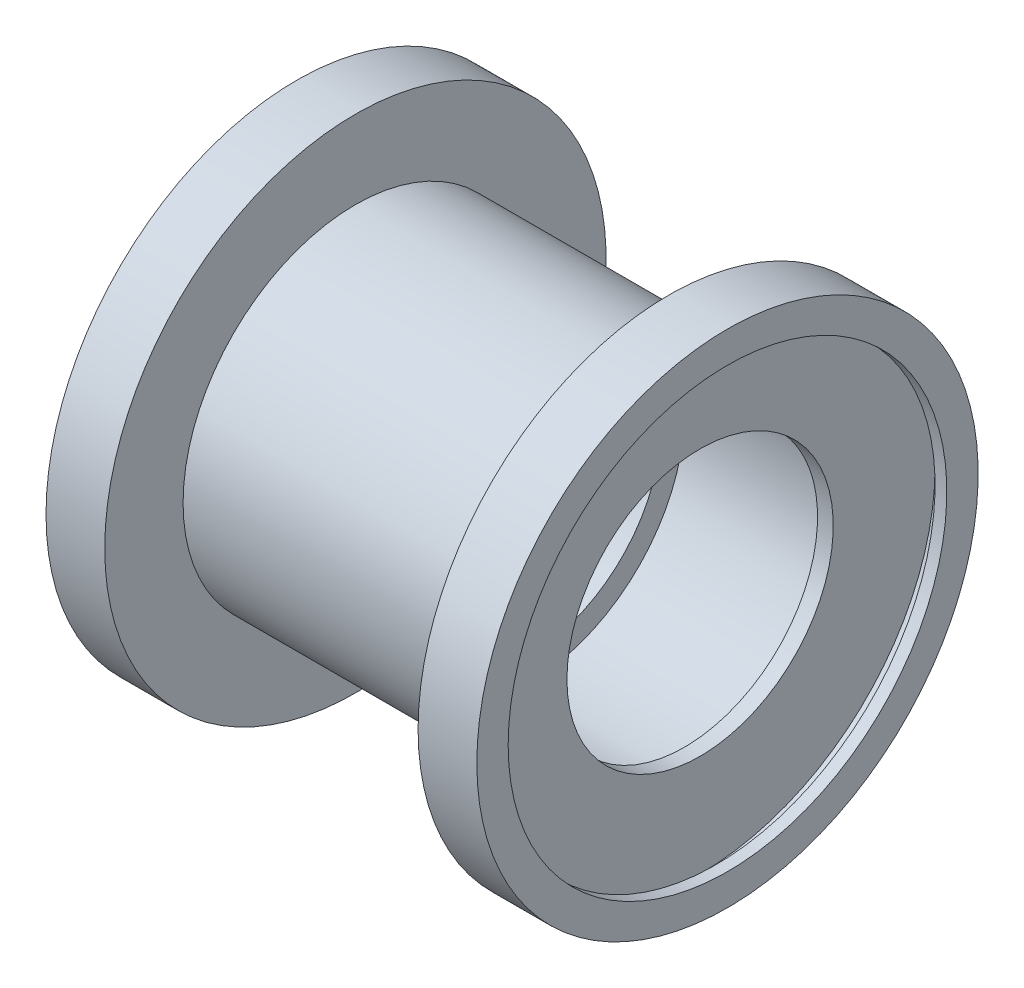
ISO-10303-21;
HEADER;
FILE_DESCRIPTION(('STEP AP214'),'2;1');
FILE_NAME('part.step','',(''),(''),'','','');
FILE_SCHEMA(('AUTOMOTIVE_DESIGN { 1 0 10303 214 1 1 1 1 }'));
ENDSEC;
DATA;
#1=APPLICATION_CONTEXT('core data for automotive mechanical design processes');
#2=APPLICATION_PROTOCOL_DEFINITION('international standard','automotive_design',2000,#1);
#3=PRODUCT_CONTEXT('',#1,'mechanical');
#4=PRODUCT('Part','Part','',(#3));
#5=PRODUCT_RELATED_PRODUCT_CATEGORY('part','',(#4));
#6=PRODUCT_DEFINITION_FORMATION('','',#4);
#7=PRODUCT_DEFINITION_CONTEXT('part definition',#1,'design');
#8=PRODUCT_DEFINITION('design','',#6,#7);
#9=PRODUCT_DEFINITION_SHAPE('','',#8);
#10=(LENGTH_UNIT() NAMED_UNIT(*) SI_UNIT(.MILLI.,.METRE.));
#11=(NAMED_UNIT(*) PLANE_ANGLE_UNIT() SI_UNIT($,.RADIAN.));
#12=(NAMED_UNIT(*) SI_UNIT($,.STERADIAN.) SOLID_ANGLE_UNIT());
#13=UNCERTAINTY_MEASURE_WITH_UNIT(LENGTH_MEASURE(1.E-05),#10,'distance_accuracy_value','');
#14=(GEOMETRIC_REPRESENTATION_CONTEXT(3) GLOBAL_UNCERTAINTY_ASSIGNED_CONTEXT((#13)) GLOBAL_UNIT_ASSIGNED_CONTEXT((#10,
#11,#12)) REPRESENTATION_CONTEXT('',''));
#15=CARTESIAN_POINT('',(0.,0.,0.));
#16=DIRECTION('',(0.,0.,1.));
#17=DIRECTION('',(1.,0.,0.));
#18=AXIS2_PLACEMENT_3D('',#15,#16,#17);
#19=CARTESIAN_POINT('',(0.,0.,0.));
#20=DIRECTION('',(-1.,0.,0.));
#21=DIRECTION('',(0.,0.,1.));
#22=AXIS2_PLACEMENT_3D('',#19,#20,#21);
#23=CYLINDRICAL_SURFACE('',#22,8.5);
#24=CARTESIAN_POINT('',(1.,0.,0.));
#25=DIRECTION('',(-1.,0.,0.));
#26=DIRECTION('',(0.,0.,1.));
#27=AXIS2_PLACEMENT_3D('',#24,#25,#26);
#28=CIRCLE('',#27,8.5);
#29=CARTESIAN_POINT('',(1.,0.,8.5));
#30=VERTEX_POINT('',#29);
#31=EDGE_CURVE('E68',#30,#30,#28,.T.);
#32=ORIENTED_EDGE('',*,*,#31,.F.);
#33=EDGE_LOOP('',(#32));
#34=FACE_BOUND('',#33,.T.);
#35=CARTESIAN_POINT('',(-1.,0.,0.));
#36=DIRECTION('',(-1.,0.,0.));
#37=DIRECTION('',(0.,0.,1.));
#38=AXIS2_PLACEMENT_3D('',#35,#36,#37);
#39=CIRCLE('',#38,8.5);
#40=CARTESIAN_POINT('',(-1.,0.,8.5));
#41=VERTEX_POINT('',#40);
#42=EDGE_CURVE('E104',#41,#41,#39,.T.);
#43=ORIENTED_EDGE('',*,*,#42,.T.);
#44=EDGE_LOOP('',(#43));
#45=FACE_BOUND('',#44,.T.);
#46=ADVANCED_FACE('F28',(#34,#45),#23,.F.);
#47=CARTESIAN_POINT('',(0.,0.,0.));
#48=DIRECTION('',(-1.,0.,0.));
#49=DIRECTION('',(0.,0.,1.));
#50=AXIS2_PLACEMENT_3D('',#47,#48,#49);
#51=CYLINDRICAL_SURFACE('',#50,11.);
#52=CARTESIAN_POINT('',(10.,0.,0.));
#53=DIRECTION('',(-1.,0.,0.));
#54=DIRECTION('',(0.,0.,1.));
#55=AXIS2_PLACEMENT_3D('',#52,#53,#54);
#56=CIRCLE('',#55,11.);
#57=CARTESIAN_POINT('',(10.,0.,11.));
#58=VERTEX_POINT('',#57);
#59=EDGE_CURVE('E10',#58,#58,#56,.T.);
#60=ORIENTED_EDGE('',*,*,#59,.T.);
#61=EDGE_LOOP('',(#60));
#62=FACE_BOUND('',#61,.T.);
#63=CARTESIAN_POINT('',(-10.,0.,0.));
#64=DIRECTION('',(-1.,0.,0.));
#65=DIRECTION('',(0.,0.,1.));
#66=AXIS2_PLACEMENT_3D('',#63,#64,#65);
#67=CIRCLE('',#66,11.);
#68=CARTESIAN_POINT('',(-10.,0.,11.));
#69=VERTEX_POINT('',#68);
#70=EDGE_CURVE('E71',#69,#69,#67,.T.);
#71=ORIENTED_EDGE('',*,*,#70,.F.);
#72=EDGE_LOOP('',(#71));
#73=FACE_BOUND('',#72,.T.);
#74=ADVANCED_FACE('F121',(#62,#73),#51,.T.);
#75=CARTESIAN_POINT('',(10.,11.,0.));
#76=DIRECTION('',(1.,0.,0.));
#77=DIRECTION('',(0.,0.,-1.));
#78=AXIS2_PLACEMENT_3D('',#75,#76,#77);
#79=PLANE('',#78);
#80=ORIENTED_EDGE('',*,*,#59,.F.);
#81=EDGE_LOOP('',(#80));
#82=FACE_BOUND('',#81,.T.);
#83=CARTESIAN_POINT('',(10.,0.,0.));
#84=DIRECTION('',(-1.,0.,0.));
#85=DIRECTION('',(0.,0.,1.));
#86=AXIS2_PLACEMENT_3D('',#83,#84,#85);
#87=CIRCLE('',#86,16.);
#88=CARTESIAN_POINT('',(10.,0.,16.));
#89=VERTEX_POINT('',#88);
#90=EDGE_CURVE('E34',#89,#89,#87,.T.);
#91=ORIENTED_EDGE('',*,*,#90,.T.);
#92=EDGE_LOOP('',(#91));
#93=FACE_BOUND('',#92,.T.);
#94=ADVANCED_FACE('F126',(#82,#93),#79,.F.);
#95=CARTESIAN_POINT('',(0.,0.,0.));
#96=DIRECTION('',(-1.,0.,0.));
#97=DIRECTION('',(0.,0.,1.));
#98=AXIS2_PLACEMENT_3D('',#95,#96,#97);
#99=CYLINDRICAL_SURFACE('',#98,16.);
#100=ORIENTED_EDGE('',*,*,#90,.F.);
#101=EDGE_LOOP('',(#100));
#102=FACE_BOUND('',#101,.T.);
#103=CARTESIAN_POINT('',(13.75,0.,0.));
#104=DIRECTION('',(-1.,0.,0.));
#105=DIRECTION('',(0.,0.,1.));
#106=AXIS2_PLACEMENT_3D('',#103,#104,#105);
#107=CIRCLE('',#106,16.);
#108=CARTESIAN_POINT('',(13.75,0.,16.));
#109=VERTEX_POINT('',#108);
#110=EDGE_CURVE('E38',#109,#109,#107,.T.);
#111=ORIENTED_EDGE('',*,*,#110,.T.);
#112=EDGE_LOOP('',(#111));
#113=FACE_BOUND('',#112,.T.);
#114=ADVANCED_FACE('F174',(#102,#113),#99,.T.);
#115=CARTESIAN_POINT('',(13.75,16.,0.));
#116=DIRECTION('',(-1.,0.,0.));
#117=DIRECTION('',(0.,0.,1.));
#118=AXIS2_PLACEMENT_3D('',#115,#116,#117);
#119=PLANE('',#118);
#120=ORIENTED_EDGE('',*,*,#110,.F.);
#121=EDGE_LOOP('',(#120));
#122=FACE_BOUND('',#121,.T.);
#123=CARTESIAN_POINT('',(13.75,0.,0.));
#124=DIRECTION('',(-1.,0.,0.));
#125=DIRECTION('',(0.,0.,1.));
#126=AXIS2_PLACEMENT_3D('',#123,#124,#125);
#127=CIRCLE('',#126,14.);
#128=CARTESIAN_POINT('',(13.75,0.,14.));
#129=VERTEX_POINT('',#128);
#130=EDGE_CURVE('E42',#129,#129,#127,.T.);
#131=ORIENTED_EDGE('',*,*,#130,.T.);
#132=EDGE_LOOP('',(#131));
#133=FACE_BOUND('',#132,.T.);
#134=ADVANCED_FACE('F170',(#122,#133),#119,.F.);
#135=CARTESIAN_POINT('',(0.,0.,0.));
#136=DIRECTION('',(-1.,0.,0.));
#137=DIRECTION('',(0.,0.,1.));
#138=AXIS2_PLACEMENT_3D('',#135,#136,#137);
#139=CYLINDRICAL_SURFACE('',#138,14.);
#140=ORIENTED_EDGE('',*,*,#130,.F.);
#141=EDGE_LOOP('',(#140));
#142=FACE_BOUND('',#141,.T.);
#143=CARTESIAN_POINT('',(13.,0.,0.));
#144=DIRECTION('',(-1.,0.,0.));
#145=DIRECTION('',(0.,0.,1.));
#146=AXIS2_PLACEMENT_3D('',#143,#144,#145);
#147=CIRCLE('',#146,14.);
#148=CARTESIAN_POINT('',(13.,0.,14.));
#149=VERTEX_POINT('',#148);
#150=EDGE_CURVE('E47',#149,#149,#147,.T.);
#151=ORIENTED_EDGE('',*,*,#150,.T.);
#152=EDGE_LOOP('',(#151));
#153=FACE_BOUND('',#152,.T.);
#154=ADVANCED_FACE('F166',(#142,#153),#139,.F.);
#155=CARTESIAN_POINT('',(13.,14.,0.));
#156=DIRECTION('',(1.,0.,0.));
#157=DIRECTION('',(0.,0.,-1.));
#158=AXIS2_PLACEMENT_3D('',#155,#156,#157);
#159=PLANE('',#158);
#160=ORIENTED_EDGE('',*,*,#150,.F.);
#161=EDGE_LOOP('',(#160));
#162=FACE_BOUND('',#161,.T.);
#163=CARTESIAN_POINT('',(13.,0.,0.));
#164=DIRECTION('',(-1.,0.,0.));
#165=DIRECTION('',(0.,0.,1.));
#166=AXIS2_PLACEMENT_3D('',#163,#164,#165);
#167=CIRCLE('',#166,15.);
#168=CARTESIAN_POINT('',(13.,0.,15.));
#169=VERTEX_POINT('',#168);
#170=EDGE_CURVE('E50',#169,#169,#167,.T.);
#171=ORIENTED_EDGE('',*,*,#170,.T.);
#172=EDGE_LOOP('',(#171));
#173=FACE_BOUND('',#172,.T.);
#174=ADVANCED_FACE('F162',(#162,#173),#159,.F.);
#175=CARTESIAN_POINT('',(0.,0.,0.));
#176=DIRECTION('',(-1.,0.,0.));
#177=DIRECTION('',(0.,0.,1.));
#178=AXIS2_PLACEMENT_3D('',#175,#176,#177);
#179=CYLINDRICAL_SURFACE('',#178,15.);
#180=ORIENTED_EDGE('',*,*,#170,.F.);
#181=EDGE_LOOP('',(#180));
#182=FACE_BOUND('',#181,.T.);
#183=CARTESIAN_POINT('',(12.,0.,0.));
#184=DIRECTION('',(-1.,0.,0.));
#185=DIRECTION('',(0.,0.,1.));
#186=AXIS2_PLACEMENT_3D('',#183,#184,#185);
#187=CIRCLE('',#186,15.);
#188=CARTESIAN_POINT('',(12.,0.,15.));
#189=VERTEX_POINT('',#188);
#190=EDGE_CURVE('E53',#189,#189,#187,.T.);
#191=ORIENTED_EDGE('',*,*,#190,.T.);
#192=EDGE_LOOP('',(#191));
#193=FACE_BOUND('',#192,.T.);
#194=ADVANCED_FACE('F158',(#182,#193),#179,.F.);
#195=CARTESIAN_POINT('',(12.,15.,0.));
#196=DIRECTION('',(-1.,0.,0.));
#197=DIRECTION('',(0.,0.,1.));
#198=AXIS2_PLACEMENT_3D('',#195,#196,#197);
#199=PLANE('',#198);
#200=ORIENTED_EDGE('',*,*,#190,.F.);
#201=EDGE_LOOP('',(#200));
#202=FACE_BOUND('',#201,.T.);
#203=CARTESIAN_POINT('',(12.,0.,0.));
#204=DIRECTION('',(-1.,0.,0.));
#205=DIRECTION('',(0.,0.,1.));
#206=AXIS2_PLACEMENT_3D('',#203,#204,#205);
#207=CIRCLE('',#206,8.5);
#208=CARTESIAN_POINT('',(12.,0.,8.5));
#209=VERTEX_POINT('',#208);
#210=EDGE_CURVE('E56',#209,#209,#207,.T.);
#211=ORIENTED_EDGE('',*,*,#210,.T.);
#212=EDGE_LOOP('',(#211));
#213=FACE_BOUND('',#212,.T.);
#214=ADVANCED_FACE('F154',(#202,#213),#199,.F.);
#215=CARTESIAN_POINT('',(0.,0.,0.));
#216=DIRECTION('',(-1.,0.,0.));
#217=DIRECTION('',(0.,0.,1.));
#218=AXIS2_PLACEMENT_3D('',#215,#216,#217);
#219=CYLINDRICAL_SURFACE('',#218,8.5);
#220=ORIENTED_EDGE('',*,*,#210,.F.);
#221=EDGE_LOOP('',(#220));
#222=FACE_BOUND('',#221,.T.);
#223=CARTESIAN_POINT('',(11.,0.,0.));
#224=DIRECTION('',(-1.,0.,0.));
#225=DIRECTION('',(0.,0.,1.));
#226=AXIS2_PLACEMENT_3D('',#223,#224,#225);
#227=CIRCLE('',#226,8.5);
#228=CARTESIAN_POINT('',(11.,0.,8.5));
#229=VERTEX_POINT('',#228);
#230=EDGE_CURVE('E59',#229,#229,#227,.T.);
#231=ORIENTED_EDGE('',*,*,#230,.T.);
#232=EDGE_LOOP('',(#231));
#233=FACE_BOUND('',#232,.T.);
#234=ADVANCED_FACE('F150',(#222,#233),#219,.F.);
#235=CARTESIAN_POINT('',(11.,8.5,0.));
#236=DIRECTION('',(1.,0.,0.));
#237=DIRECTION('',(0.,0.,-1.));
#238=AXIS2_PLACEMENT_3D('',#235,#236,#237);
#239=PLANE('',#238);
#240=ORIENTED_EDGE('',*,*,#230,.F.);
#241=EDGE_LOOP('',(#240));
#242=FACE_BOUND('',#241,.T.);
#243=CARTESIAN_POINT('',(11.,0.,0.));
#244=DIRECTION('',(-1.,0.,0.));
#245=DIRECTION('',(0.,0.,1.));
#246=AXIS2_PLACEMENT_3D('',#243,#244,#245);
#247=CIRCLE('',#246,10.);
#248=CARTESIAN_POINT('',(11.,0.,10.));
#249=VERTEX_POINT('',#248);
#250=EDGE_CURVE('E62',#249,#249,#247,.T.);
#251=ORIENTED_EDGE('',*,*,#250,.T.);
#252=EDGE_LOOP('',(#251));
#253=FACE_BOUND('',#252,.T.);
#254=ADVANCED_FACE('F142',(#242,#253),#239,.F.);
#255=CARTESIAN_POINT('',(0.,0.,0.));
#256=DIRECTION('',(-1.,0.,0.));
#257=DIRECTION('',(0.,0.,1.));
#258=AXIS2_PLACEMENT_3D('',#255,#256,#257);
#259=CYLINDRICAL_SURFACE('',#258,9.99999999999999);
#260=ORIENTED_EDGE('',*,*,#250,.F.);
#261=EDGE_LOOP('',(#260));
#262=FACE_BOUND('',#261,.T.);
#263=CARTESIAN_POINT('',(1.,0.,0.));
#264=DIRECTION('',(-1.,0.,0.));
#265=DIRECTION('',(0.,0.,1.));
#266=AXIS2_PLACEMENT_3D('',#263,#264,#265);
#267=CIRCLE('',#266,9.99999999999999);
#268=CARTESIAN_POINT('',(1.,0.,9.99999999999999));
#269=VERTEX_POINT('',#268);
#270=EDGE_CURVE('E65',#269,#269,#267,.T.);
#271=ORIENTED_EDGE('',*,*,#270,.T.);
#272=EDGE_LOOP('',(#271));
#273=FACE_BOUND('',#272,.T.);
#274=ADVANCED_FACE('F132',(#262,#273),#259,.F.);
#275=CARTESIAN_POINT('',(1.,9.99999999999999,0.));
#276=DIRECTION('',(-1.,0.,0.));
#277=DIRECTION('',(0.,0.,1.));
#278=AXIS2_PLACEMENT_3D('',#275,#276,#277);
#279=PLANE('',#278);
#280=ORIENTED_EDGE('',*,*,#270,.F.);
#281=EDGE_LOOP('',(#280));
#282=FACE_BOUND('',#281,.T.);
#283=ORIENTED_EDGE('',*,*,#31,.T.);
#284=EDGE_LOOP('',(#283));
#285=FACE_BOUND('',#284,.T.);
#286=ADVANCED_FACE('F129',(#282,#285),#279,.F.);
#287=CARTESIAN_POINT('',(-10.,11.,0.));
#288=DIRECTION('',(-1.,0.,0.));
#289=DIRECTION('',(0.,0.,-1.));
#290=AXIS2_PLACEMENT_3D('',#287,#288,#289);
#291=PLANE('',#290);
#292=ORIENTED_EDGE('',*,*,#70,.T.);
#293=EDGE_LOOP('',(#292));
#294=FACE_BOUND('',#293,.T.);
#295=CARTESIAN_POINT('',(-10.,0.,0.));
#296=DIRECTION('',(-1.,0.,0.));
#297=DIRECTION('',(0.,0.,1.));
#298=AXIS2_PLACEMENT_3D('',#295,#296,#297);
#299=CIRCLE('',#298,16.);
#300=CARTESIAN_POINT('',(-10.,0.,16.));
#301=VERTEX_POINT('',#300);
#302=EDGE_CURVE('E74',#301,#301,#299,.T.);
#303=ORIENTED_EDGE('',*,*,#302,.F.);
#304=EDGE_LOOP('',(#303));
#305=FACE_BOUND('',#304,.T.);
#306=ADVANCED_FACE('F131',(#294,#305),#291,.F.);
#307=CARTESIAN_POINT('',(0.,0.,0.));
#308=DIRECTION('',(1.,0.,0.));
#309=DIRECTION('',(0.,0.,1.));
#310=AXIS2_PLACEMENT_3D('',#307,#308,#309);
#311=CYLINDRICAL_SURFACE('',#310,16.);
#312=ORIENTED_EDGE('',*,*,#302,.T.);
#313=EDGE_LOOP('',(#312));
#314=FACE_BOUND('',#313,.T.);
#315=CARTESIAN_POINT('',(-13.75,0.,0.));
#316=DIRECTION('',(-1.,0.,0.));
#317=DIRECTION('',(0.,0.,1.));
#318=AXIS2_PLACEMENT_3D('',#315,#316,#317);
#319=CIRCLE('',#318,16.);
#320=CARTESIAN_POINT('',(-13.75,0.,16.));
#321=VERTEX_POINT('',#320);
#322=EDGE_CURVE('E77',#321,#321,#319,.T.);
#323=ORIENTED_EDGE('',*,*,#322,.F.);
#324=EDGE_LOOP('',(#323));
#325=FACE_BOUND('',#324,.T.);
#326=ADVANCED_FACE('F139',(#314,#325),#311,.T.);
#327=CARTESIAN_POINT('',(-13.75,16.,0.));
#328=DIRECTION('',(1.,0.,0.));
#329=DIRECTION('',(0.,0.,1.));
#330=AXIS2_PLACEMENT_3D('',#327,#328,#329);
#331=PLANE('',#330);
#332=ORIENTED_EDGE('',*,*,#322,.T.);
#333=EDGE_LOOP('',(#332));
#334=FACE_BOUND('',#333,.T.);
#335=CARTESIAN_POINT('',(-13.75,0.,0.));
#336=DIRECTION('',(-1.,0.,0.));
#337=DIRECTION('',(0.,0.,1.));
#338=AXIS2_PLACEMENT_3D('',#335,#336,#337);
#339=CIRCLE('',#338,14.);
#340=CARTESIAN_POINT('',(-13.75,0.,14.));
#341=VERTEX_POINT('',#340);
#342=EDGE_CURVE('E80',#341,#341,#339,.T.);
#343=ORIENTED_EDGE('',*,*,#342,.F.);
#344=EDGE_LOOP('',(#343));
#345=FACE_BOUND('',#344,.T.);
#346=ADVANCED_FACE('F242',(#334,#345),#331,.F.);
#347=CARTESIAN_POINT('',(0.,0.,0.));
#348=DIRECTION('',(1.,0.,0.));
#349=DIRECTION('',(0.,0.,1.));
#350=AXIS2_PLACEMENT_3D('',#347,#348,#349);
#351=CYLINDRICAL_SURFACE('',#350,14.);
#352=ORIENTED_EDGE('',*,*,#342,.T.);
#353=EDGE_LOOP('',(#352));
#354=FACE_BOUND('',#353,.T.);
#355=CARTESIAN_POINT('',(-13.,0.,0.));
#356=DIRECTION('',(-1.,0.,0.));
#357=DIRECTION('',(0.,0.,1.));
#358=AXIS2_PLACEMENT_3D('',#355,#356,#357);
#359=CIRCLE('',#358,14.);
#360=CARTESIAN_POINT('',(-13.,0.,14.));
#361=VERTEX_POINT('',#360);
#362=EDGE_CURVE('E83',#361,#361,#359,.T.);
#363=ORIENTED_EDGE('',*,*,#362,.F.);
#364=EDGE_LOOP('',(#363));
#365=FACE_BOUND('',#364,.T.);
#366=ADVANCED_FACE('F251',(#354,#365),#351,.F.);
#367=CARTESIAN_POINT('',(-13.,14.,0.));
#368=DIRECTION('',(-1.,0.,0.));
#369=DIRECTION('',(0.,0.,-1.));
#370=AXIS2_PLACEMENT_3D('',#367,#368,#369);
#371=PLANE('',#370);
#372=ORIENTED_EDGE('',*,*,#362,.T.);
#373=EDGE_LOOP('',(#372));
#374=FACE_BOUND('',#373,.T.);
#375=CARTESIAN_POINT('',(-13.,0.,0.));
#376=DIRECTION('',(-1.,0.,0.));
#377=DIRECTION('',(0.,0.,1.));
#378=AXIS2_PLACEMENT_3D('',#375,#376,#377);
#379=CIRCLE('',#378,15.);
#380=CARTESIAN_POINT('',(-13.,0.,15.));
#381=VERTEX_POINT('',#380);
#382=EDGE_CURVE('E86',#381,#381,#379,.T.);
#383=ORIENTED_EDGE('',*,*,#382,.F.);
#384=EDGE_LOOP('',(#383));
#385=FACE_BOUND('',#384,.T.);
#386=ADVANCED_FACE('F261',(#374,#385),#371,.F.);
#387=CARTESIAN_POINT('',(0.,0.,0.));
#388=DIRECTION('',(1.,0.,0.));
#389=DIRECTION('',(0.,0.,1.));
#390=AXIS2_PLACEMENT_3D('',#387,#388,#389);
#391=CYLINDRICAL_SURFACE('',#390,15.);
#392=ORIENTED_EDGE('',*,*,#382,.T.);
#393=EDGE_LOOP('',(#392));
#394=FACE_BOUND('',#393,.T.);
#395=CARTESIAN_POINT('',(-12.,0.,0.));
#396=DIRECTION('',(-1.,0.,0.));
#397=DIRECTION('',(0.,0.,1.));
#398=AXIS2_PLACEMENT_3D('',#395,#396,#397);
#399=CIRCLE('',#398,15.);
#400=CARTESIAN_POINT('',(-12.,0.,15.));
#401=VERTEX_POINT('',#400);
#402=EDGE_CURVE('E89',#401,#401,#399,.T.);
#403=ORIENTED_EDGE('',*,*,#402,.F.);
#404=EDGE_LOOP('',(#403));
#405=FACE_BOUND('',#404,.T.);
#406=ADVANCED_FACE('F271',(#394,#405),#391,.F.);
#407=CARTESIAN_POINT('',(-12.,15.,0.));
#408=DIRECTION('',(1.,0.,0.));
#409=DIRECTION('',(0.,0.,1.));
#410=AXIS2_PLACEMENT_3D('',#407,#408,#409);
#411=PLANE('',#410);
#412=ORIENTED_EDGE('',*,*,#402,.T.);
#413=EDGE_LOOP('',(#412));
#414=FACE_BOUND('',#413,.T.);
#415=CARTESIAN_POINT('',(-12.,0.,0.));
#416=DIRECTION('',(-1.,0.,0.));
#417=DIRECTION('',(0.,0.,1.));
#418=AXIS2_PLACEMENT_3D('',#415,#416,#417);
#419=CIRCLE('',#418,8.5);
#420=CARTESIAN_POINT('',(-12.,0.,8.5));
#421=VERTEX_POINT('',#420);
#422=EDGE_CURVE('E92',#421,#421,#419,.T.);
#423=ORIENTED_EDGE('',*,*,#422,.F.);
#424=EDGE_LOOP('',(#423));
#425=FACE_BOUND('',#424,.T.);
#426=ADVANCED_FACE('F281',(#414,#425),#411,.F.);
#427=CARTESIAN_POINT('',(0.,0.,0.));
#428=DIRECTION('',(1.,0.,0.));
#429=DIRECTION('',(0.,0.,1.));
#430=AXIS2_PLACEMENT_3D('',#427,#428,#429);
#431=CYLINDRICAL_SURFACE('',#430,8.5);
#432=ORIENTED_EDGE('',*,*,#422,.T.);
#433=EDGE_LOOP('',(#432));
#434=FACE_BOUND('',#433,.T.);
#435=CARTESIAN_POINT('',(-11.,0.,0.));
#436=DIRECTION('',(-1.,0.,0.));
#437=DIRECTION('',(0.,0.,1.));
#438=AXIS2_PLACEMENT_3D('',#435,#436,#437);
#439=CIRCLE('',#438,8.5);
#440=CARTESIAN_POINT('',(-11.,0.,8.5));
#441=VERTEX_POINT('',#440);
#442=EDGE_CURVE('E95',#441,#441,#439,.T.);
#443=ORIENTED_EDGE('',*,*,#442,.F.);
#444=EDGE_LOOP('',(#443));
#445=FACE_BOUND('',#444,.T.);
#446=ADVANCED_FACE('F291',(#434,#445),#431,.F.);
#447=CARTESIAN_POINT('',(-11.,8.5,0.));
#448=DIRECTION('',(-1.,0.,0.));
#449=DIRECTION('',(0.,0.,-1.));
#450=AXIS2_PLACEMENT_3D('',#447,#448,#449);
#451=PLANE('',#450);
#452=ORIENTED_EDGE('',*,*,#442,.T.);
#453=EDGE_LOOP('',(#452));
#454=FACE_BOUND('',#453,.T.);
#455=CARTESIAN_POINT('',(-11.,0.,0.));
#456=DIRECTION('',(-1.,0.,0.));
#457=DIRECTION('',(0.,0.,1.));
#458=AXIS2_PLACEMENT_3D('',#455,#456,#457);
#459=CIRCLE('',#458,10.);
#460=CARTESIAN_POINT('',(-11.,0.,10.));
#461=VERTEX_POINT('',#460);
#462=EDGE_CURVE('E98',#461,#461,#459,.T.);
#463=ORIENTED_EDGE('',*,*,#462,.F.);
#464=EDGE_LOOP('',(#463));
#465=FACE_BOUND('',#464,.T.);
#466=ADVANCED_FACE('F117',(#454,#465),#451,.F.);
#467=CARTESIAN_POINT('',(0.,0.,0.));
#468=DIRECTION('',(1.,0.,0.));
#469=DIRECTION('',(0.,0.,1.));
#470=AXIS2_PLACEMENT_3D('',#467,#468,#469);
#471=CYLINDRICAL_SURFACE('',#470,9.99999999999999);
#472=ORIENTED_EDGE('',*,*,#462,.T.);
#473=EDGE_LOOP('',(#472));
#474=FACE_BOUND('',#473,.T.);
#475=CARTESIAN_POINT('',(-1.,0.,0.));
#476=DIRECTION('',(-1.,0.,0.));
#477=DIRECTION('',(0.,0.,1.));
#478=AXIS2_PLACEMENT_3D('',#475,#476,#477);
#479=CIRCLE('',#478,9.99999999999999);
#480=CARTESIAN_POINT('',(-1.,0.,9.99999999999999));
#481=VERTEX_POINT('',#480);
#482=EDGE_CURVE('E101',#481,#481,#479,.T.);
#483=ORIENTED_EDGE('',*,*,#482,.F.);
#484=EDGE_LOOP('',(#483));
#485=FACE_BOUND('',#484,.T.);
#486=ADVANCED_FACE('F111',(#474,#485),#471,.F.);
#487=CARTESIAN_POINT('',(-1.,9.99999999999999,0.));
#488=DIRECTION('',(1.,0.,0.));
#489=DIRECTION('',(0.,0.,1.));
#490=AXIS2_PLACEMENT_3D('',#487,#488,#489);
#491=PLANE('',#490);
#492=ORIENTED_EDGE('',*,*,#482,.T.);
#493=EDGE_LOOP('',(#492));
#494=FACE_BOUND('',#493,.T.);
#495=ORIENTED_EDGE('',*,*,#42,.F.);
#496=EDGE_LOOP('',(#495));
#497=FACE_BOUND('',#496,.T.);
#498=ADVANCED_FACE('F109',(#494,#497),#491,.F.);
#499=CLOSED_SHELL('',(#46,#74,#94,#114,#134,#154,#174,#194,#214,#234,#254,#274,#286,#306,#326,
#346,#366,#386,#406,#426,#446,#466,#486,#498));
#500=MANIFOLD_SOLID_BREP('B2',#499);
#501=ADVANCED_BREP_SHAPE_REPRESENTATION('',(#18,#500),#14);
#502=SHAPE_DEFINITION_REPRESENTATION(#9,#501);
ENDSEC;
END-ISO-10303-21;
